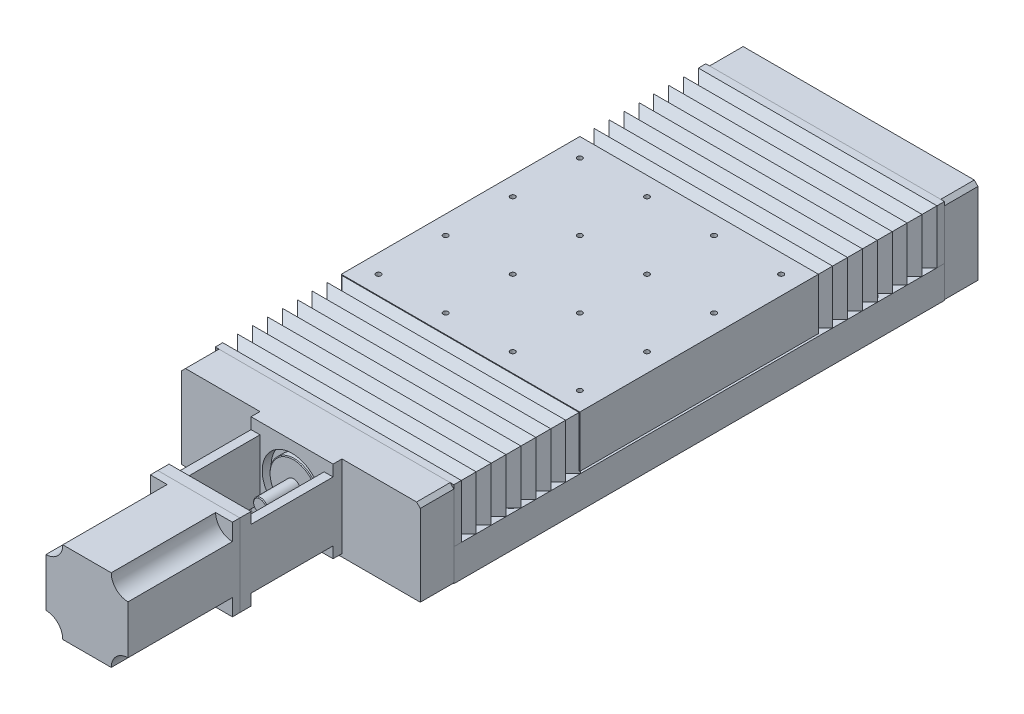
from build123d import *

# Parameters (mm, degrees)
EXTRUDE_1_DEPTH              = 658
SKETCH_2_W                   = 180
SKETCH_2_H                   = 1
CUT_EXTRUDE_1_DEPTH          = 678.634857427
SKETCH_3_W                   = 28
SKETCH_3_H                   = 658
EXTRUDE_2_DEPTH              = 42
EXTRUDE_2_2_DEPTH            = 42
EXTRUDE_3_DEPTH              = 160
SKETCH_5_W                   = 90
SKETCH_5_H                   = 57
SKETCH_5_R                   = 17.5
EXTRUDE_4_DEPTH              = 150
CHAMFER_1_SIZE               = 10
SKETCH_6_R                   = 25
CUT_EXTRUDE_2_DEPTH          = 90
SKETCH_7_W                   = 92.691152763
SKETCH_7_H                   = 55.470337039
CUT_EXTRUDE_3_DEPTH          = 14
SKETCH_8_W                   = 320
SKETCH_8_H                   = 114
EXTRUDE_5_DEPTH              = 45
SKETCH_9_W                   = 320
SKETCH_9_H                   = 114
EXTRUDE_6_DEPTH              = 45
SKETCH_10_R                  = 16
EXTRUDE_7_DEPTH              = 703
SKETCH_11_R                  = 9.5
EXTRUDE_8_DEPTH              = 55
SKETCH_12_R                  = 32.5
EXTRUDE_9_DEPTH              = 10
PATTERN_LINEAR_1_COUNT       = 4
PATTERN_LINEAR_1_PITCH       = 160
PATTERN_LINEAR_2_COUNT       = 2
PATTERN_LINEAR_2_PITCH       = 295
SKETCH_27_W                  = 110
SKETCH_27_H                  = 110
SKETCH_27_R                  = 40
EXTRUDE_18_DEPTH             = 12
SKETCH_28_W                  = 12
SKETCH_28_H                  = 110
EXTRUDE_19_DEPTH             = 110
SKETCH_29_W                  = 110
SKETCH_29_H                  = 110
SKETCH_29_R                  = 40
EXTRUDE_20_DEPTH             = 15
SKETCH_30_W                  = 110
SKETCH_30_H                  = 110
EXTRUDE_21_DEPTH             = 150
SKETCH_31_R                  = 9.5
EXTRUDE_22_DEPTH             = 56
SKETCH_32_R                  = 22.5
CUT_EXTRUDE_6_DEPTH          = 140
SKETCH_33_W                  = 110
SKETCH_33_H                  = 15
CUT_EXTRUDE_8_DEPTH          = 1018.066861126
HOLE_WIZARD_M8_1_AT_2_COUNT  = 2
HOLE_WIZARD_M8_1_AT_2_PITCH  = 90
HOLE_WIZARD_M8_1_AT_3_COUNT  = 2
HOLE_WIZARD_M8_1_AT_3_PITCH  = 127.279220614
HOLE_WIZARD_M8_1_AT_4_COUNT  = 2
HOLE_WIZARD_M8_1_AT_4_PITCH  = 90
HOLE_WIZARD_M8_1_AT_5_COUNT  = 2
HOLE_WIZARD_M8_1_AT_5_PITCH  = 180
HOLE_WIZARD_M8_1_AT_6_COUNT  = 2
HOLE_WIZARD_M8_1_AT_6_PITCH  = 201.246117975
HOLE_WIZARD_M8_1_AT_7_COUNT  = 2
HOLE_WIZARD_M8_1_AT_7_PITCH  = 284.604989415
HOLE_WIZARD_M8_1_AT_8_COUNT  = 2
HOLE_WIZARD_M8_1_AT_8_PITCH  = 270
HOLE_WIZARD_M8_1_AT_9_COUNT  = 2
HOLE_WIZARD_M8_1_AT_9_PITCH  = 324.499614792
HOLE_WIZARD_M8_1_AT_10_COUNT = 2
HOLE_WIZARD_M8_1_AT_10_PITCH = 381.837661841
HOLE_WIZARD_M8_1_AT_11_COUNT = 2
HOLE_WIZARD_M8_1_AT_11_PITCH = 324.499614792
HOLE_WIZARD_M8_1_AT_12_COUNT = 2
HOLE_WIZARD_M8_1_AT_12_PITCH = 254.558441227
HOLE_WIZARD_M8_1_AT_13_COUNT = 2
HOLE_WIZARD_M8_1_AT_13_PITCH = 201.246117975
HOLE_WIZARD_M8_1_AT_14_COUNT = 2
HOLE_WIZARD_M8_1_AT_14_PITCH = 284.604989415
HOLE_WIZARD_M8_1_AT_15_COUNT = 2
HOLE_WIZARD_M8_1_AT_15_PITCH = 180
HOLE_WIZARD_M8_1_AT_16_COUNT = 2
HOLE_WIZARD_M8_1_AT_16_PITCH = 270
CHAMFER_2_SIZE               = 5
CHAMFER_3_SIZE               = 5
CHAMFER_4_SIZE               = 1


with BuildPart() as part:
    # Sketch 1 → Extrude 1 (new body)
    with BuildSketch(Plane.XY):
        Polygon((80, 0), (-80, 0), (-80, 23), (-101, 23), (-101, 20), (-129, 20), (-129, 18), (-160, 18), (-160, -25), (160, -25), (160, 18), (129, 18), (129, 20), (101, 20), (101, 23), (80, 23), align=None)
    extrude(amount=EXTRUDE_1_DEPTH)

    # Sketch 2 → Cut-Extrude 1 (cut, through all)
    with BuildSketch(Plane.XY.offset(658)):
        with Locations((0, -24.5)):
            Rectangle(SKETCH_2_W, SKETCH_2_H)
    extrude(amount=-CUT_EXTRUDE_1_DEPTH, mode=Mode.SUBTRACT)



with BuildPart() as body_2:
    # Sketch 3 → Extrude 2 (new body)
    with BuildSketch(Plane(origin=(0, 20, 0), x_dir=(1, 0, 0), z_dir=(0, 1, 0))):
        with Locations((-115, -329)):
            Rectangle(SKETCH_3_W, SKETCH_3_H)
    extrude(amount=EXTRUDE_2_DEPTH)


with BuildPart() as body_3:
    # Sketch 3 → Extrude 2 2 (new body)
    with BuildSketch(Plane(origin=(0, 20, 0), x_dir=(1, 0, 0), z_dir=(0, 1, 0))):
        with Locations((115, -329)):
            Rectangle(SKETCH_3_W, SKETCH_3_H)
    extrude(amount=EXTRUDE_2_2_DEPTH)


with BuildPart() as part_1:
    add(part.part)

    add(body_3.part)  # Extrude 3 merges body 3

    add(body_2.part)  # Extrude 3 merges body 2
    # Sketch 4 → Extrude 3 (add, symmetric)
    with BuildSketch(Plane.XY.offset(329)):
        Polygon((-115, 62), (-85, 62), (-85, 59), (-45, 59), (-45, 62), (45, 62), (45, 59), (85, 59), (85, 62), (115, 62), (145, 62), (145, 59), (150, 59), (150, 21), (160, 21), (160, 90), (-160, 90), (-160, 21), (-150, 21), (-150, 59), (-145, 59), (-145, 62), align=None)
    extrude(amount=EXTRUDE_3_DEPTH, both=True)

    # Sketch 5 → Extrude 4 (add)
    with BuildSketch(Plane.XY.offset(489)):
        with Locations((0, 33.5)):
            Rectangle(SKETCH_5_W, SKETCH_5_H)
        with Locations((0, 35)):
            Circle(SKETCH_5_R, mode=Mode.SUBTRACT)
    extrude(amount=-EXTRUDE_4_DEPTH)

    # Chamfer 1
    chamfer_1_edges = [part_1.edges().sort_by_distance(p)[0] for p in [
        (-45, 5, 414),
        (45, 5, 414),
    ]]
    chamfer(chamfer_1_edges, length=CHAMFER_1_SIZE)

    # Sketch 6 → Cut-Extrude 2 (cut)
    with BuildSketch(Plane.XY.offset(489)):
        with Locations((0, 35)):
            Circle(SKETCH_6_R)
    extrude(amount=-CUT_EXTRUDE_2_DEPTH, mode=Mode.SUBTRACT)

    # Sketch 7 → Cut-Extrude 3 (cut)
    with BuildSketch(Plane.XY.offset(489)):
        with Locations((1.345576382, 31.264831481)):
            Rectangle(SKETCH_7_W, SKETCH_7_H)
    extrude(amount=-CUT_EXTRUDE_3_DEPTH, mode=Mode.SUBTRACT)

    # Sketch 14 → Hole Wizard 1 (revolve, cut)
    with BuildSketch(Plane(origin=(-147.5, 18, 89), x_dir=(0, 0, 1), z_dir=(1, 0, 0))):
        Polygon((0, 0), (0, 43), (5.5, 43), (5.5, 11), (9, 11), (9, 0), align=None)
    hole_wizard_1 = revolve(axis=Axis((-147.5, 24.35, 89), (0, -1, 0)), mode=Mode.SUBTRACT)

    # Pattern Linear 1: Hole Wizard 1 ×4
    with Locations(*[(0, 0, i * PATTERN_LINEAR_1_PITCH) for i in range(1, PATTERN_LINEAR_1_COUNT)]):
        add(hole_wizard_1, mode=Mode.SUBTRACT)

    # Pattern Linear 2: Hole Wizard 1 ×2
    with Locations(*[(i * PATTERN_LINEAR_2_PITCH, 0, 0) for i in range(1, PATTERN_LINEAR_2_COUNT)]):
        add(hole_wizard_1, mode=Mode.SUBTRACT)

    # Pattern Linear 2 copy 1 sketch → Pattern Linear 2 copy 1 (revolve, cut)
    with BuildSketch(Plane(origin=(147.5, 18, 249), x_dir=(0, 0, 1), z_dir=(1, 0, 0))):
        Polygon((0, 0), (0, 43), (5.5, 43), (5.5, 11), (9, 11), (9, 0), align=None)
    revolve(axis=Axis((147.5, 24.35, 249), (0, -1, 0)), mode=Mode.SUBTRACT)

    # Pattern Linear 2 copy 2 sketch → Pattern Linear 2 copy 2 (revolve, cut)
    with BuildSketch(Plane(origin=(147.5, 18, 409), x_dir=(0, 0, 1), z_dir=(1, 0, 0))):
        Polygon((0, 0), (0, 43), (5.5, 43), (5.5, 11), (9, 11), (9, 0), align=None)
    revolve(axis=Axis((147.5, 24.35, 409), (0, -1, 0)), mode=Mode.SUBTRACT)

    # Pattern Linear 2 copy 3 sketch → Pattern Linear 2 copy 3 (revolve, cut)
    with BuildSketch(Plane(origin=(147.5, 18, 569), x_dir=(0, 0, 1), z_dir=(1, 0, 0))):
        Polygon((0, 0), (0, 43), (5.5, 43), (5.5, 11), (9, 11), (9, 0), align=None)
    revolve(axis=Axis((147.5, 24.35, 569), (0, -1, 0)), mode=Mode.SUBTRACT)

    # Sketch 35 → Hole Wizard M8 _1 (revolve, cut)
    with BuildSketch(Plane(origin=(-135, 90, 194), x_dir=(0, 0, 1), z_dir=(1, 0, 0))):
        Polygon((0, 0), (0, 21.792926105), (3.4, 19.75), (3.4, 0), align=None)
    hole_wizard_m8_1 = revolve(axis=Axis((-135, 96.35, 194), (0, -1, 0)), mode=Mode.SUBTRACT)

    # Hole Wizard M8 _1 at 2: Hole Wizard M8 _1 ×2
    with Locations(*[(0, 0, i * HOLE_WIZARD_M8_1_AT_2_PITCH) for i in range(1, HOLE_WIZARD_M8_1_AT_2_COUNT)]):
        add(hole_wizard_m8_1, mode=Mode.SUBTRACT)

    # Hole Wizard M8 _1 at 3: Hole Wizard M8 _1 ×2
    with Locations(*[Vector(0.7071067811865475, 0, 0.7071067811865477) * (i * HOLE_WIZARD_M8_1_AT_3_PITCH) for i in range(1, HOLE_WIZARD_M8_1_AT_3_COUNT)]):
        add(hole_wizard_m8_1, mode=Mode.SUBTRACT)

    # Hole Wizard M8 _1 at 4: Hole Wizard M8 _1 ×2
    with Locations(*[(i * HOLE_WIZARD_M8_1_AT_4_PITCH, 0, 0) for i in range(1, HOLE_WIZARD_M8_1_AT_4_COUNT)]):
        add(hole_wizard_m8_1, mode=Mode.SUBTRACT)

    # Hole Wizard M8 _1 at 5: Hole Wizard M8 _1 ×2
    with Locations(*[(i * HOLE_WIZARD_M8_1_AT_5_PITCH, 0, 0) for i in range(1, HOLE_WIZARD_M8_1_AT_5_COUNT)]):
        add(hole_wizard_m8_1, mode=Mode.SUBTRACT)

    # Hole Wizard M8 _1 at 6: Hole Wizard M8 _1 ×2
    with Locations(*[Vector(0.894427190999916, 0, 0.447213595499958) * (i * HOLE_WIZARD_M8_1_AT_6_PITCH) for i in range(1, HOLE_WIZARD_M8_1_AT_6_COUNT)]):
        add(hole_wizard_m8_1, mode=Mode.SUBTRACT)

    # Hole Wizard M8 _1 at 7: Hole Wizard M8 _1 ×2
    with Locations(*[Vector(0.9486832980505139, 0, 0.3162277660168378) * (i * HOLE_WIZARD_M8_1_AT_7_PITCH) for i in range(1, HOLE_WIZARD_M8_1_AT_7_COUNT)]):
        add(hole_wizard_m8_1, mode=Mode.SUBTRACT)

    # Hole Wizard M8 _1 at 8: Hole Wizard M8 _1 ×2
    with Locations(*[(i * HOLE_WIZARD_M8_1_AT_8_PITCH, 0, 0) for i in range(1, HOLE_WIZARD_M8_1_AT_8_COUNT)]):
        add(hole_wizard_m8_1, mode=Mode.SUBTRACT)

    # Hole Wizard M8 _1 at 9: Hole Wizard M8 _1 ×2
    with Locations(*[Vector(0.8320502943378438, 0, 0.5547001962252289) * (i * HOLE_WIZARD_M8_1_AT_9_PITCH) for i in range(1, HOLE_WIZARD_M8_1_AT_9_COUNT)]):
        add(hole_wizard_m8_1, mode=Mode.SUBTRACT)

    # Hole Wizard M8 _1 at 10: Hole Wizard M8 _1 ×2
    with Locations(*[Vector(0.7071067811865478, 0, 0.7071067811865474) * (i * HOLE_WIZARD_M8_1_AT_10_PITCH) for i in range(1, HOLE_WIZARD_M8_1_AT_10_COUNT)]):
        add(hole_wizard_m8_1, mode=Mode.SUBTRACT)

    # Hole Wizard M8 _1 at 11: Hole Wizard M8 _1 ×2
    with Locations(*[Vector(0.5547001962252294, 0, 0.8320502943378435) * (i * HOLE_WIZARD_M8_1_AT_11_PITCH) for i in range(1, HOLE_WIZARD_M8_1_AT_11_COUNT)]):
        add(hole_wizard_m8_1, mode=Mode.SUBTRACT)

    # Hole Wizard M8 _1 at 12: Hole Wizard M8 _1 ×2
    with Locations(*[Vector(0.7071067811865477, 0, 0.7071067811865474) * (i * HOLE_WIZARD_M8_1_AT_12_PITCH) for i in range(1, HOLE_WIZARD_M8_1_AT_12_COUNT)]):
        add(hole_wizard_m8_1, mode=Mode.SUBTRACT)

    # Hole Wizard M8 _1 at 13: Hole Wizard M8 _1 ×2
    with Locations(*[Vector(0.447213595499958, 0, 0.894427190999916) * (i * HOLE_WIZARD_M8_1_AT_13_PITCH) for i in range(1, HOLE_WIZARD_M8_1_AT_13_COUNT)]):
        add(hole_wizard_m8_1, mode=Mode.SUBTRACT)

    # Hole Wizard M8 _1 at 14: Hole Wizard M8 _1 ×2
    with Locations(*[Vector(0.316227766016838, 0, 0.9486832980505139) * (i * HOLE_WIZARD_M8_1_AT_14_PITCH) for i in range(1, HOLE_WIZARD_M8_1_AT_14_COUNT)]):
        add(hole_wizard_m8_1, mode=Mode.SUBTRACT)

    # Hole Wizard M8 _1 at 15: Hole Wizard M8 _1 ×2
    with Locations(*[(0, 0, i * HOLE_WIZARD_M8_1_AT_15_PITCH) for i in range(1, HOLE_WIZARD_M8_1_AT_15_COUNT)]):
        add(hole_wizard_m8_1, mode=Mode.SUBTRACT)

    # Hole Wizard M8 _1 at 16: Hole Wizard M8 _1 ×2
    with Locations(*[(0, 0, i * HOLE_WIZARD_M8_1_AT_16_PITCH) for i in range(1, HOLE_WIZARD_M8_1_AT_16_COUNT)]):
        add(hole_wizard_m8_1, mode=Mode.SUBTRACT)


with BuildPart() as body_2_2:
    # Sketch 8 → Extrude 5 (new body)
    with BuildSketch(Plane.XY.offset(658)):
        with Locations((0, 33)):
            Rectangle(SKETCH_8_W, SKETCH_8_H)
    extrude(amount=EXTRUDE_5_DEPTH)



with BuildPart() as body_3_2:
    # Sketch 9 → Extrude 6 (new body)
    with BuildSketch(Plane(origin=(0, 0, 0), x_dir=(-1, 0, 0), z_dir=(0, 0, -1))):
        with Locations((0, 33)):
            Rectangle(SKETCH_9_W, SKETCH_9_H)
    extrude(amount=EXTRUDE_6_DEPTH)

    # Chamfer 3
    chamfer_3_edges = [body_3_2.edges().sort_by_distance(p)[0] for p in [
        (160, 90, -22.5),
        (-160, 90, -22.5),
    ]]
    chamfer(chamfer_3_edges, length=CHAMFER_3_SIZE)


with BuildPart() as body_4:
    # Sketch 10 → Extrude 7 (new body)
    with BuildSketch(Plane.XY):
        with Locations((0, 35)):
            Circle(SKETCH_10_R)
    extrude(amount=EXTRUDE_7_DEPTH)


with BuildPart() as body_2_2_1:
    add(body_2_2.part)

    add(body_4.part)  # Extrude 8 merges body 4
    # Sketch 11 → Extrude 8 (add)
    with BuildSketch(Plane.XY.offset(703)):
        with Locations((0, 35)):
            Circle(SKETCH_11_R)
    extrude(amount=EXTRUDE_8_DEPTH)

    # Sketch 12 → Extrude 9 (add)
    with BuildSketch(Plane.XY.offset(703)):
        with Locations((0, 35)):
            Circle(SKETCH_12_R)
    extrude(amount=EXTRUDE_9_DEPTH)



with BuildPart() as body_4_2:
    # Sketch 27 → Extrude 18 (new body)
    with BuildSketch(Plane.XY.offset(703)):
        with Locations((0, 35)):
            Rectangle(SKETCH_27_W, SKETCH_27_H)
        with Locations((0, 35)):
            Circle(SKETCH_27_R, mode=Mode.SUBTRACT)
    extrude(amount=EXTRUDE_18_DEPTH)


with BuildPart() as body_2_2_2:
    add(body_2_2_1.part)

    add(body_4_2.part)  # Extrude 19 merges body 4 2
    # Sketch 28 → Extrude 19 (add)
    with BuildSketch(Plane.XY.offset(715)):
        with Locations((-49, 35)):
            Rectangle(SKETCH_28_W, SKETCH_28_H)
        with Locations((49, 35)):
            Rectangle(SKETCH_28_W, SKETCH_28_H)
    extrude(amount=EXTRUDE_19_DEPTH)

    # Sketch 29 → Extrude 20 (add)
    with BuildSketch(Plane.XY.offset(825)):
        with Locations((0, 35)):
            Rectangle(SKETCH_29_W, SKETCH_29_H)
        with Locations((0, 35)):
            Circle(SKETCH_29_R, mode=Mode.SUBTRACT)
    extrude(amount=EXTRUDE_20_DEPTH)

    # Sketch 33 → Cut-Extrude 8 (cut, through all)
    with BuildSketch(Plane.ZY.offset(55)):
        with Locations((770, 82.5)):
            Rectangle(SKETCH_33_W, SKETCH_33_H)
        with Locations((770, -12.5)):
            Rectangle(SKETCH_33_W, SKETCH_33_H)
    extrude(amount=-CUT_EXTRUDE_8_DEPTH, mode=Mode.SUBTRACT)

    # Chamfer 2
    chamfer_2_edges = [body_2_2_2.edges().sort_by_distance(p)[0] for p in [
        (-160, 90, 680.5),
        (160, 90, 680.5),
    ]]
    chamfer(chamfer_2_edges, length=CHAMFER_2_SIZE)

    # Chamfer 4
    chamfer_4_edges = [body_2_2_2.edges().sort_by_distance(p)[0] for p in [
        (-9.5, 35, 758),
        (-32.5, 35, 713),
    ]]
    chamfer(chamfer_4_edges, length=CHAMFER_4_SIZE)


with BuildPart() as body_4_3:
    # Sketch 30 → Extrude 21 (new body)
    with BuildSketch(Plane.XY.offset(840)):
        with Locations((0, 35)):
            Rectangle(SKETCH_30_W, SKETCH_30_H)
    extrude(amount=EXTRUDE_21_DEPTH)

    # Sketch 32 → Cut-Extrude 6 (cut)
    with BuildSketch(Plane.XY.offset(990)):
        with Locations((-55, 90)):
            Circle(SKETCH_32_R)
        with Locations((55, 90)):
            Circle(SKETCH_32_R)
        with Locations((-55, -20)):
            Circle(SKETCH_32_R)
        with Locations((55, -20)):
            Circle(SKETCH_32_R)
    extrude(amount=-CUT_EXTRUDE_6_DEPTH, mode=Mode.SUBTRACT)


with BuildPart() as body_5:
    # Sketch 31 → Extrude 22 (new body)
    with BuildSketch(Plane(origin=(0, 0, 840), x_dir=(-1, 0, 0), z_dir=(0, 0, -1))):
        with Locations((0, 31.616033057)):
            Circle(SKETCH_31_R)
    extrude(amount=EXTRUDE_22_DEPTH)


solid = Compound([part_1.part, body_3_2.part, body_2_2_2.part, body_4_3.part, body_5.part])
